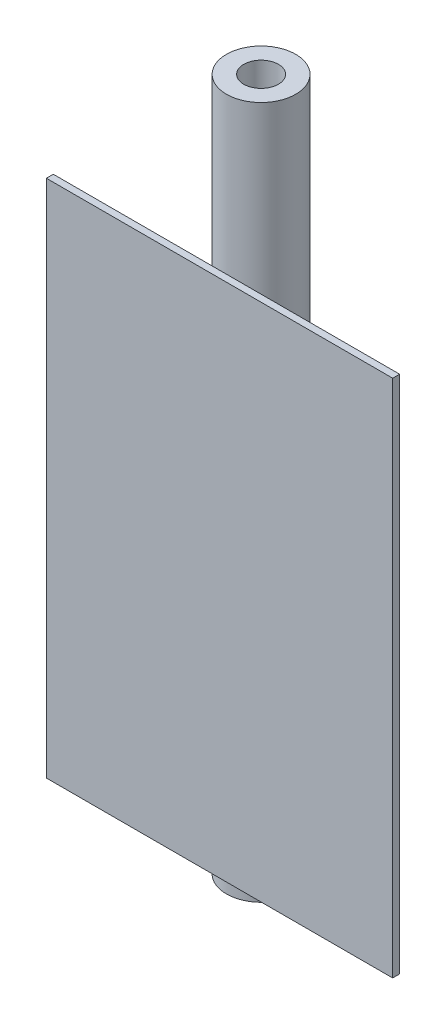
from build123d import *

# Parameters (mm, degrees)
SKIZZE1_R                       = 10
SKIZZE1_R_2                     = 5
AUFSATZ_LINEAR_AUSTRAGEN1_DEPTH = 200
SKIZZE3_W                       = 100
SKIZZE3_H                       = 150
AUFSATZ_LINEAR_AUSTRAGEN3_DEPTH = 2


with BuildPart() as part:
    # Skizze1 → Aufsatz-Linear austragen1 (new body)
    with BuildSketch(Plane(origin=(0, 0, 0), x_dir=(1, 0, 0), z_dir=(0, 1, 0))):
        with Locations(Location((0, 0, 0), (0, 0, 270))):
            Circle(SKIZZE1_R)
        with Locations(Location((0, 0, 0), (0, 0, 270))):
            Circle(SKIZZE1_R_2, mode=Mode.SUBTRACT)
    extrude(amount=AUFSATZ_LINEAR_AUSTRAGEN1_DEPTH)


with BuildPart() as body_2:
    # Skizze3 → Aufsatz-Linear austragen3 (new body)
    with BuildSketch(Plane.XY.offset(10)):
        with Locations((0, 80)):
            Rectangle(SKIZZE3_W, SKIZZE3_H)
    extrude(amount=AUFSATZ_LINEAR_AUSTRAGEN3_DEPTH)


solid = Compound([part.part, body_2.part])
